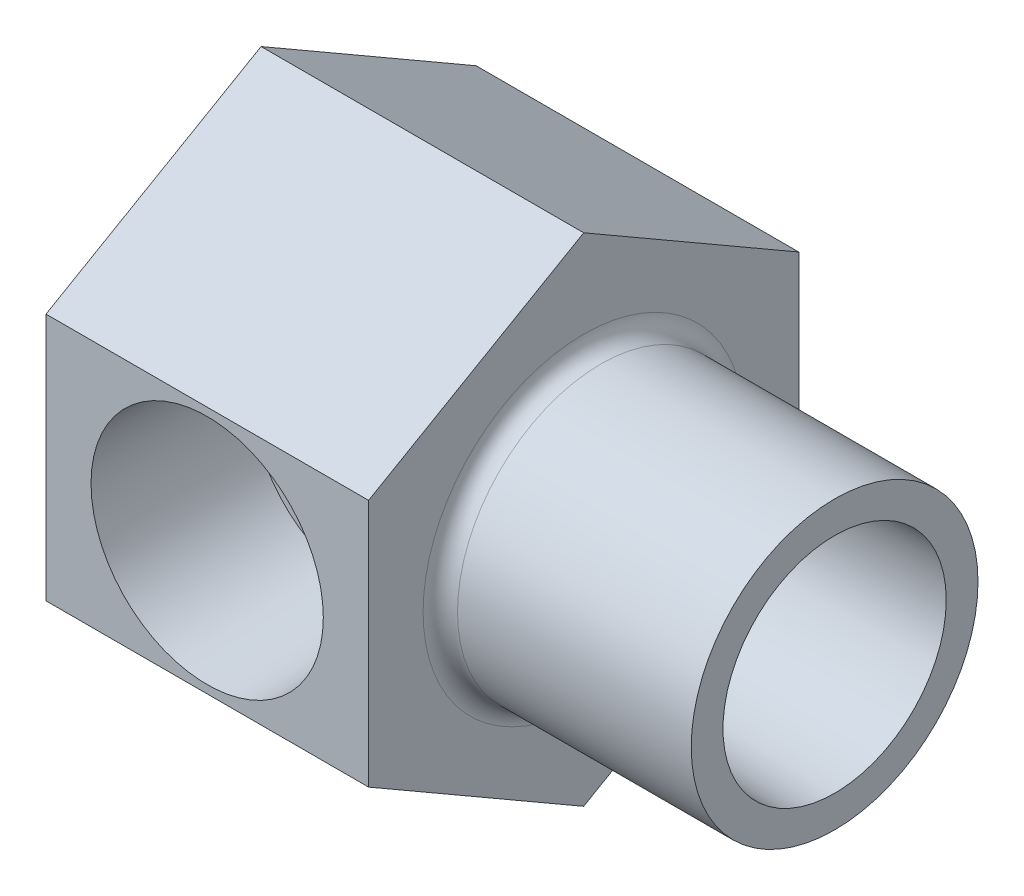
ISO-10303-21;
HEADER;
FILE_DESCRIPTION(('STEP AP214'),'2;1');
FILE_NAME('part.step','',(''),(''),'','','');
FILE_SCHEMA(('AUTOMOTIVE_DESIGN { 1 0 10303 214 1 1 1 1 }'));
ENDSEC;
DATA;
#1=APPLICATION_CONTEXT('core data for automotive mechanical design processes');
#2=APPLICATION_PROTOCOL_DEFINITION('international standard','automotive_design',2000,#1);
#3=PRODUCT_CONTEXT('',#1,'mechanical');
#4=PRODUCT('Part','Part','',(#3));
#5=PRODUCT_RELATED_PRODUCT_CATEGORY('part','',(#4));
#6=PRODUCT_DEFINITION_FORMATION('','',#4);
#7=PRODUCT_DEFINITION_CONTEXT('part definition',#1,'design');
#8=PRODUCT_DEFINITION('design','',#6,#7);
#9=PRODUCT_DEFINITION_SHAPE('','',#8);
#10=(LENGTH_UNIT() NAMED_UNIT(*) SI_UNIT(.MILLI.,.METRE.));
#11=(NAMED_UNIT(*) PLANE_ANGLE_UNIT() SI_UNIT($,.RADIAN.));
#12=(NAMED_UNIT(*) SI_UNIT($,.STERADIAN.) SOLID_ANGLE_UNIT());
#13=UNCERTAINTY_MEASURE_WITH_UNIT(LENGTH_MEASURE(1.E-05),#10,'distance_accuracy_value','');
#14=(GEOMETRIC_REPRESENTATION_CONTEXT(3) GLOBAL_UNCERTAINTY_ASSIGNED_CONTEXT((#13)) GLOBAL_UNIT_ASSIGNED_CONTEXT((#10,
#11,#12)) REPRESENTATION_CONTEXT('',''));
#15=CARTESIAN_POINT('',(0.,0.,0.));
#16=DIRECTION('',(0.,0.,1.));
#17=DIRECTION('',(1.,0.,0.));
#18=AXIS2_PLACEMENT_3D('',#15,#16,#17);
#19=CARTESIAN_POINT('',(-6.9596,0.,0.));
#20=DIRECTION('',(1.,0.,0.));
#21=DIRECTION('',(0.,0.,-1.));
#22=AXIS2_PLACEMENT_3D('',#19,#20,#21);
#23=CONICAL_SURFACE('',#22,4.2164,1.02974425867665);
#24=CARTESIAN_POINT('',(-6.73376018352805,3.22891481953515,-3.26541976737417));
#25=CARTESIAN_POINT('',(-6.73947200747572,3.29609728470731,-3.185629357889));
#26=CARTESIAN_POINT('',(-6.74538598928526,3.36029462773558,-3.10334220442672));
#27=CARTESIAN_POINT('',(-6.7575935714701,3.48238703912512,-2.93425567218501));
#28=CARTESIAN_POINT('',(-6.7638871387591,3.54028265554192,-2.84745668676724));
#29=CARTESIAN_POINT('',(-6.77684374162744,3.64956563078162,-2.66962780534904));
#30=CARTESIAN_POINT('',(-6.78350752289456,3.70093911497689,-2.57858943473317));
#31=CARTESIAN_POINT('',(-6.79716565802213,3.79675451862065,-2.39295588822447));
#32=CARTESIAN_POINT('',(-6.80416003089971,3.84119603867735,-2.29836050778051));
#33=CARTESIAN_POINT('',(-6.81940631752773,3.92836238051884,-2.09328071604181));
#34=CARTESIAN_POINT('',(-6.82770134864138,3.97006355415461,-1.98236269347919));
#35=CARTESIAN_POINT('',(-6.84463376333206,4.04393671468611,-1.75742117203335));
#36=CARTESIAN_POINT('',(-6.8532711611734,4.07610830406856,-1.64339754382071));
#37=CARTESIAN_POINT('',(-6.87082068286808,4.13063558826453,-1.41330247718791));
#38=CARTESIAN_POINT('',(-6.87973219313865,4.15301170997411,-1.29723583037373));
#39=CARTESIAN_POINT('',(-6.89779137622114,4.18787866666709,-1.06369323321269));
#40=CARTESIAN_POINT('',(-6.90693893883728,4.2003740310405,-0.946217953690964));
#41=CARTESIAN_POINT('',(-6.92329024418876,4.2136785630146,-0.737768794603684));
#42=CARTESIAN_POINT('',(-6.93045699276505,4.21651498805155,-0.646916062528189));
#43=CARTESIAN_POINT('',(-6.94487329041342,4.21627786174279,-0.465214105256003));
#44=CARTESIAN_POINT('',(-6.95212284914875,4.21320361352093,-0.374364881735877));
#45=CARTESIAN_POINT('',(-6.96885138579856,4.19935208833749,-0.165960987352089));
#46=CARTESIAN_POINT('',(-6.97834931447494,4.18654776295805,-0.0485372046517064));
#47=CARTESIAN_POINT('',(-6.99737520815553,4.15106537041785,0.184852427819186));
#48=CARTESIAN_POINT('',(-7.00690318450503,4.12838297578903,0.300817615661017));
#49=CARTESIAN_POINT('',(-7.02593176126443,4.07326389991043,0.53059288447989));
#50=CARTESIAN_POINT('',(-7.03543230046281,4.04081286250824,0.644399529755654));
#51=CARTESIAN_POINT('',(-7.05432381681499,3.96638566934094,0.86891078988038));
#52=CARTESIAN_POINT('',(-7.06371475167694,3.92440595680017,0.979614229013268));
#53=CARTESIAN_POINT('',(-7.08229902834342,3.8312791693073,1.19696658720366));
#54=CARTESIAN_POINT('',(-7.09149257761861,3.78014230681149,1.30361986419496));
#55=CARTESIAN_POINT('',(-7.10962004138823,3.66901304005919,1.51228248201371));
#56=CARTESIAN_POINT('',(-7.11855385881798,3.60901737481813,1.61429009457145));
#57=CARTESIAN_POINT('',(-7.1360737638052,3.48066096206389,1.81281840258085));
#58=CARTESIAN_POINT('',(-7.14466011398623,3.41230669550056,1.90934326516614));
#59=CARTESIAN_POINT('',(-7.16141704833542,3.26765530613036,2.09634161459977));
#60=CARTESIAN_POINT('',(-7.16958747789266,3.19135526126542,2.18681285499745));
#61=CARTESIAN_POINT('',(-7.18542989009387,3.03138463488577,2.36101374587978));
#62=CARTESIAN_POINT('',(-7.19310192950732,2.94771489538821,2.44474416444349));
#63=CARTESIAN_POINT('',(-7.20787423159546,2.77355964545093,2.6049115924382));
#64=CARTESIAN_POINT('',(-7.21497428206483,2.68307162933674,2.68134589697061));
#65=CARTESIAN_POINT('',(-7.22852278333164,2.49597839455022,2.82632284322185));
#66=CARTESIAN_POINT('',(-7.23497142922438,2.39937502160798,2.8948678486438));
#67=CARTESIAN_POINT('',(-7.24715119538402,2.20067639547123,3.02363152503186));
#68=CARTESIAN_POINT('',(-7.25288204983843,2.09857912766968,3.08384711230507));
#69=CARTESIAN_POINT('',(-7.26355643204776,1.88968543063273,3.19547701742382));
#70=CARTESIAN_POINT('',(-7.26850022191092,1.78289058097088,3.24689426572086));
#71=CARTESIAN_POINT('',(-7.27754633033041,1.56529157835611,3.34060580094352));
#72=CARTESIAN_POINT('',(-7.28164833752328,1.45448595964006,3.38289671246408));
#73=CARTESIAN_POINT('',(-7.28895737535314,1.22972174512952,3.45801767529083));
#74=CARTESIAN_POINT('',(-7.29216474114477,1.11576434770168,3.49085126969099));
#75=CARTESIAN_POINT('',(-7.29764824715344,0.885466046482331,3.54685856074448));
#76=CARTESIAN_POINT('',(-7.29992404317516,0.769124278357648,3.57002868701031));
#77=CARTESIAN_POINT('',(-7.30530210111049,0.417866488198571,3.62472545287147));
#78=CARTESIAN_POINT('',(-7.30696375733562,0.180450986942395,3.64152743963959));
#79=CARTESIAN_POINT('',(-7.30634050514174,-0.293714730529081,3.6352076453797));
#80=CARTESIAN_POINT('',(-7.30405560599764,-0.530464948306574,3.61208595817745));
#81=CARTESIAN_POINT('',(-7.29566099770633,-0.996716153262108,3.52661690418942));
#82=CARTESIAN_POINT('',(-7.28955164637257,-1.2262178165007,3.46427320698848));
#83=CARTESIAN_POINT('',(-7.27381113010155,-1.67143805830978,3.30211300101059));
#84=CARTESIAN_POINT('',(-7.26417998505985,-1.88715671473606,3.20229670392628));
#85=CARTESIAN_POINT('',(-7.24185058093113,-2.29871947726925,2.96800412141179));
#86=CARTESIAN_POINT('',(-7.22915208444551,-2.49456204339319,2.83352515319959));
#87=CARTESIAN_POINT('',(-7.20124690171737,-2.86080409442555,2.53370051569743));
#88=CARTESIAN_POINT('',(-7.18604008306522,-3.03120223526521,2.36835321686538));
#89=CARTESIAN_POINT('',(-7.15373137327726,-3.34173868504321,2.01144326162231));
#90=CARTESIAN_POINT('',(-7.13662909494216,-3.48187079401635,1.81987524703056));
#91=CARTESIAN_POINT('',(-7.10116480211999,-3.7278239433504,1.41600572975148));
#92=CARTESIAN_POINT('',(-7.08280311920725,-3.83365397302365,1.20370967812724));
#93=CARTESIAN_POINT('',(-7.04691898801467,-4.00110507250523,0.781889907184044));
#94=CARTESIAN_POINT('',(-7.02944568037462,-4.06556937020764,0.573484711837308));
#95=CARTESIAN_POINT('',(-6.99439704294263,-4.16139473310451,0.149206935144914));
#96=CARTESIAN_POINT('',(-6.97682171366,-4.19275596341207,-0.0666656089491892));
#97=CARTESIAN_POINT('',(-6.94047902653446,-4.22284116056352,-0.519424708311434));
#98=CARTESIAN_POINT('',(-6.92173924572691,-4.21852420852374,-0.756520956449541));
#99=CARTESIAN_POINT('',(-6.88509942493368,-4.17001705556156,-1.22674372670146));
#100=CARTESIAN_POINT('',(-6.86719970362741,-4.12581184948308,-1.45986872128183));
#101=CARTESIAN_POINT('',(-6.83266356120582,-3.99877765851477,-1.91548196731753));
#102=CARTESIAN_POINT('',(-6.81602745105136,-3.9159392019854,-2.13796759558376));
#103=CARTESIAN_POINT('',(-6.78439344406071,-3.71398256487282,-2.56583018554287));
#104=CARTESIAN_POINT('',(-6.76939415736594,-3.59489549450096,-2.77122162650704));
#105=CARTESIAN_POINT('',(-6.74772297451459,-3.38563805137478,-3.07082385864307));
#106=CARTESIAN_POINT('',(-6.74036352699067,-3.30690755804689,-3.17315498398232));
#107=CARTESIAN_POINT('',(-6.72627390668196,-3.14051730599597,-3.37001977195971));
#108=CARTESIAN_POINT('',(-6.71954265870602,-3.0528733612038,-3.46456672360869));
#109=CARTESIAN_POINT('',(-6.71313562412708,-2.9610208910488,-3.55494720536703));
#110=B_SPLINE_CURVE_WITH_KNOTS('',3,(#24,#25,#26,#27,#28,#29,#30,#31,#32,#33,#34,#35,#36,#37,
#38,#39,#40,#41,#42,#43,#44,#45,#46,#47,#48,#49,#50,#51,#52,#53,#54,#55,#56,#57,#58,#59,#60,#61,
#62,#63,#64,#65,#66,#67,#68,#69,#70,#71,#72,#73,#74,#75,#76,#77,#78,#79,#80,#81,#82,#83,#84,#85,
#86,#87,#88,#89,#90,#91,#92,#93,#94,#95,#96,#97,#98,#99,#100,#101,#102,#103,#104,#105,#106,#107,
#108,#109),.UNSPECIFIED.,.F.,.F.,(4,2,2,2,2,2,2,2,2,2,2,2,2,2,2,2,2,2,2,2,2,2,2,2,2,2,2,2,2,2,2,
2,2,2,2,2,2,2,2,2,2,2,4),(0.,0.313315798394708,0.626604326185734,0.94054853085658,
1.25451081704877,1.61044299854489,1.9663900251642,2.32159120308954,2.6766294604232,
2.94998279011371,3.22336835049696,3.57843483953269,3.93365703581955,4.28940384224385,
4.64528365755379,5.00076902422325,5.35638557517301,5.71172812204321,6.0672018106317,
6.4226349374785,6.77819932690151,7.13365690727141,7.48924573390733,7.8447158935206,
8.2003173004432,8.55578531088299,8.91138454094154,9.6217489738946,10.3321117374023,
11.0424080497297,11.7527003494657,12.4630476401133,13.1734324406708,13.8839626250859,
14.5943064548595,15.2482430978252,15.9021764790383,16.6123853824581,17.3228615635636,
18.0335120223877,18.7435542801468,19.1310374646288,19.5178448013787),.UNSPECIFIED.);
#111=CARTESIAN_POINT('',(-6.9596,4.20701167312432,-0.281214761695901));
#112=VERTEX_POINT('',#111);
#113=CARTESIAN_POINT('',(-6.9596,-4.20701167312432,-0.281214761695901));
#114=VERTEX_POINT('',#113);
#115=EDGE_CURVE('E228',#112,#114,#110,.T.);
#116=ORIENTED_EDGE('',*,*,#115,.F.);
#117=CARTESIAN_POINT('',(-6.9596,0.,0.));
#118=DIRECTION('',(1.,0.,0.));
#119=DIRECTION('',(0.,0.,-1.));
#120=AXIS2_PLACEMENT_3D('',#117,#118,#119);
#121=CIRCLE('',#120,4.2164);
#122=EDGE_CURVE('E266',#112,#114,#121,.T.);
#123=ORIENTED_EDGE('',*,*,#122,.T.);
#124=EDGE_LOOP('',(#116,#123));
#125=FACE_BOUND('',#124,.T.);
#126=ADVANCED_FACE('F16',(#125),#23,.F.);
#127=CARTESIAN_POINT('',(0.,0.,0.));
#128=DIRECTION('',(1.,0.,0.));
#129=DIRECTION('',(0.,0.,-1.));
#130=AXIS2_PLACEMENT_3D('',#127,#128,#129);
#131=CYLINDRICAL_SURFACE('',#130,4.2164);
#132=CARTESIAN_POINT('',(2.1310769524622E-12,0.,0.));
#133=DIRECTION('',(0.0403737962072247,0.,-0.999184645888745));
#134=DIRECTION('',(0.999184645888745,0.,0.0403737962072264));
#135=AXIS2_PLACEMENT_3D('',#132,#133,#134);
#136=ELLIPSE('',#135,104.434073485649,4.2164);
#137=CARTESIAN_POINT('',(-6.9342,4.20708015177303,-0.280188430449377));
#138=VERTEX_POINT('',#137);
#139=EDGE_CURVE('E234',#138,#112,#136,.F.);
#140=ORIENTED_EDGE('',*,*,#139,.F.);
#141=CARTESIAN_POINT('',(-6.9342,0.,0.));
#142=DIRECTION('',(1.,0.,0.));
#143=DIRECTION('',(0.,0.,-1.));
#144=AXIS2_PLACEMENT_3D('',#141,#142,#143);
#145=CIRCLE('',#144,4.2164);
#146=CARTESIAN_POINT('',(-6.9342,-4.20708015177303,-0.280188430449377));
#147=VERTEX_POINT('',#146);
#148=EDGE_CURVE('E263',#138,#147,#145,.T.);
#149=ORIENTED_EDGE('',*,*,#148,.T.);
#150=EDGE_CURVE('E235',#114,#147,#136,.F.);
#151=ORIENTED_EDGE('',*,*,#150,.F.);
#152=ORIENTED_EDGE('',*,*,#122,.F.);
#153=EDGE_LOOP('',(#140,#149,#151,#152));
#154=FACE_BOUND('',#153,.T.);
#155=ADVANCED_FACE('F213',(#154),#131,.F.);
#156=CARTESIAN_POINT('',(0.,0.,0.));
#157=DIRECTION('',(1.,0.,0.));
#158=DIRECTION('',(0.,0.,-1.));
#159=AXIS2_PLACEMENT_3D('',#156,#157,#158);
#160=CONICAL_SURFACE('',#159,4.9437925,0.0299323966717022);
#161=CARTESIAN_POINT('',(0.,0.,0.));
#162=DIRECTION('',(1.,0.,0.));
#163=DIRECTION('',(0.,0.,-1.));
#164=AXIS2_PLACEMENT_3D('',#161,#162,#163);
#165=CIRCLE('',#164,4.9437925);
#166=CARTESIAN_POINT('',(0.,0.,-4.9437925));
#167=VERTEX_POINT('',#166);
#168=EDGE_CURVE('E257',#167,#167,#165,.T.);
#169=ORIENTED_EDGE('',*,*,#168,.T.);
#170=EDGE_LOOP('',(#169));
#171=FACE_BOUND('',#170,.T.);
#172=CARTESIAN_POINT('',(-7.91478868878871,-2.92402848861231,-3.68838002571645));
#173=CARTESIAN_POINT('',(-7.82394341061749,-2.8614739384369,-3.74143604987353));
#174=CARTESIAN_POINT('',(-7.73588177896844,-2.79496841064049,-3.79479620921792));
#175=CARTESIAN_POINT('',(-7.56602887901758,-2.6535876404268,-3.90113119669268));
#176=CARTESIAN_POINT('',(-7.48425498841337,-2.57869051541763,-3.95410461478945));
#177=CARTESIAN_POINT('',(-7.32905229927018,-2.42127873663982,-4.0577914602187));
#178=CARTESIAN_POINT('',(-7.25554010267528,-2.33885906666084,-4.10852358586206));
#179=CARTESIAN_POINT('',(-7.11678263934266,-2.16585512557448,-4.20696117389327));
#180=CARTESIAN_POINT('',(-7.05152394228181,-2.07528453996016,-4.25467148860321));
#181=CARTESIAN_POINT('',(-6.97152555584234,-1.95093930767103,-4.31459130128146));
#182=CARTESIAN_POINT('',(-6.95273559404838,-1.92064356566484,-4.32878249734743));
#183=CARTESIAN_POINT('',(-6.85013666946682,-1.74890426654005,-4.40686524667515));
#184=CARTESIAN_POINT('',(-6.77546943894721,-1.59949285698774,-4.46599002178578));
#185=CARTESIAN_POINT('',(-6.64736312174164,-1.28688337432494,-4.56988836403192));
#186=CARTESIAN_POINT('',(-6.59396347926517,-1.12366035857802,-4.61463523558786));
#187=CARTESIAN_POINT('',(-6.50960720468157,-0.787352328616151,-4.6863183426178));
#188=CARTESIAN_POINT('',(-6.47869310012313,-0.614249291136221,-4.71322082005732));
#189=CARTESIAN_POINT('',(-6.4401118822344,-0.263625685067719,-4.74691295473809));
#190=CARTESIAN_POINT('',(-6.43243252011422,-0.0861074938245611,-4.7537132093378));
#191=CARTESIAN_POINT('',(-6.44028854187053,0.262611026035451,-4.74680729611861));
#192=CARTESIAN_POINT('',(-6.45512922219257,0.433840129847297,-4.73371476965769));
#193=CARTESIAN_POINT('',(-6.50652022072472,0.770581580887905,-4.68911866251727));
#194=CARTESIAN_POINT('',(-6.54307427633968,0.936092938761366,-4.6576119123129));
#195=CARTESIAN_POINT('',(-6.6317185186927,1.23836523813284,-4.58312904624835));
#196=CARTESIAN_POINT('',(-6.68153179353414,1.37624091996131,-4.54189392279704));
#197=CARTESIAN_POINT('',(-6.79669045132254,1.64144093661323,-4.44923514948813));
#198=CARTESIAN_POINT('',(-6.86200631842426,1.76878470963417,-4.39783089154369));
#199=CARTESIAN_POINT('',(-6.93794000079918,1.89587678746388,-4.34004270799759));
#200=CARTESIAN_POINT('',(-6.94149692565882,1.90178700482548,-4.33733982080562));
#201=CARTESIAN_POINT('',(-7.03247207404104,2.05185877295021,-4.2683147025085));
#202=CARTESIAN_POINT('',(-7.13028409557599,2.18764959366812,-4.19658926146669));
#203=CARTESIAN_POINT('',(-7.2906250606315,2.37770281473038,-4.08441114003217));
#204=CARTESIAN_POINT('',(-7.34663144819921,2.43903133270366,-4.04606671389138));
#205=CARTESIAN_POINT('',(-7.46270830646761,2.55691167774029,-3.96848051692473));
#206=CARTESIAN_POINT('',(-7.52277320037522,2.6134698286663,-3.92924002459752));
#207=CARTESIAN_POINT('',(-7.58474673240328,2.66775128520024,-3.88977056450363));
#208=B_SPLINE_CURVE_WITH_KNOTS('',3,(#172,#173,#174,#175,#176,#177,#178,#179,#180,#181,#182,
#183,#184,#185,#186,#187,#188,#189,#190,#191,#192,#193,#194,#195,#196,#197,#198,#199,#200,#201,
#202,#203,#204,#205,#206,#207),.UNSPECIFIED.,.F.,.F.,(4,2,2,2,2,2,2,2,2,2,2,2,2,2,2,2,2,4),(0.,
0.367226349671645,0.735433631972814,1.09950620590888,1.46297851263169,1.5780887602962,
2.10709113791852,2.63707011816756,3.16804887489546,3.69874766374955,4.21340483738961,
4.72815062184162,5.18355388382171,5.63809694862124,5.66032378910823,6.20382141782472,
6.47809984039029,6.75200875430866),.UNSPECIFIED.);
#209=CARTESIAN_POINT('',(-6.9342,-1.88961702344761,-4.34288898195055));
#210=VERTEX_POINT('',#209);
#211=CARTESIAN_POINT('',(-6.9342,1.88961702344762,-4.34288898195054));
#212=VERTEX_POINT('',#211);
#213=EDGE_CURVE('E203',#210,#212,#208,.T.);
#214=ORIENTED_EDGE('',*,*,#213,.F.);
#215=CARTESIAN_POINT('',(-6.9342,0.,0.));
#216=DIRECTION('',(1.,0.,0.));
#217=DIRECTION('',(0.,0.,-1.));
#218=AXIS2_PLACEMENT_3D('',#215,#216,#217);
#219=CIRCLE('',#218,4.73617326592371);
#220=EDGE_CURVE('E260',#212,#210,#219,.T.);
#221=ORIENTED_EDGE('',*,*,#220,.F.);
#222=EDGE_LOOP('',(#214,#221));
#223=FACE_BOUND('',#222,.T.);
#224=ADVANCED_FACE('F209',(#171,#223),#160,.F.);
#225=CARTESIAN_POINT('',(-18.2626,0.,-3.175));
#226=DIRECTION('',(0.,0.,1.));
#227=DIRECTION('',(1.,0.,0.));
#228=AXIS2_PLACEMENT_3D('',#225,#226,#227);
#229=CONICAL_SURFACE('',#228,4.2164,1.02974425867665);
#230=CARTESIAN_POINT('',(-16.4223731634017,3.79399540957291,-3.1748));
#231=CARTESIAN_POINT('',(-16.5494208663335,3.77897557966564,-3.21619844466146));
#232=CARTESIAN_POINT('',(-16.6775732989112,3.76471367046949,-3.25506909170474));
#233=CARTESIAN_POINT('',(-16.9367747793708,3.73938224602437,-3.32561168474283));
#234=CARTESIAN_POINT('',(-17.0678345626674,3.72832795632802,-3.35724915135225));
#235=CARTESIAN_POINT('',(-17.3285073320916,3.71150936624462,-3.4099743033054));
#236=CARTESIAN_POINT('',(-17.4580516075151,3.70560061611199,-3.4313419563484));
#237=CARTESIAN_POINT('',(-17.7184381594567,3.70005884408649,-3.46263493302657));
#238=CARTESIAN_POINT('',(-17.8492769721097,3.70041210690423,-3.47258521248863));
#239=CARTESIAN_POINT('',(-18.0603553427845,3.70637316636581,-3.4786650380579));
#240=CARTESIAN_POINT('',(-18.1405649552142,3.70989277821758,-3.47865492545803));
#241=CARTESIAN_POINT('',(-18.3007776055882,3.71927058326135,-3.4741064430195));
#242=CARTESIAN_POINT('',(-18.380780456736,3.7251304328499,-3.46956486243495));
#243=CARTESIAN_POINT('',(-18.5416642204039,3.7389979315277,-3.45612478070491));
#244=CARTESIAN_POINT('',(-18.6225353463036,3.74704202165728,-3.44715002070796));
#245=CARTESIAN_POINT('',(-18.7834690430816,3.76476889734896,-3.42531366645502));
#246=CARTESIAN_POINT('',(-18.8635325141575,3.77444957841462,-3.41245704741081));
#247=CARTESIAN_POINT('',(-18.9431730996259,3.784729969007,-3.39789901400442));
#248=B_SPLINE_CURVE_WITH_KNOTS('',3,(#230,#231,#232,#233,#234,#235,#236,#237,#238,#239,#240,
#241,#242,#243,#244,#245,#246,#247),.UNSPECIFIED.,.F.,.F.,(4,2,2,2,2,2,2,2,4),(0.,
0.403642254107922,0.809170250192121,1.20290855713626,1.59578459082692,1.83649163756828,
2.07736935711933,2.32254300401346,2.56740374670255),.UNSPECIFIED.);
#249=CARTESIAN_POINT('',(-16.4229861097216,3.7939227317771,-3.175));
#250=VERTEX_POINT('',#249);
#251=CARTESIAN_POINT('',(-18.4442611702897,3.73061642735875,-3.46423220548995));
#252=VERTEX_POINT('',#251);
#253=EDGE_CURVE('E147',#250,#252,#248,.T.);
#254=ORIENTED_EDGE('',*,*,#253,.F.);
#255=CARTESIAN_POINT('',(-18.2626,0.,-3.175));
#256=DIRECTION('',(0.,0.,1.));
#257=DIRECTION('',(1.,0.,0.));
#258=AXIS2_PLACEMENT_3D('',#255,#256,#257);
#259=CIRCLE('',#258,4.2164);
#260=CARTESIAN_POINT('',(-16.4229861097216,-3.79392273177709,-3.175));
#261=VERTEX_POINT('',#260);
#262=EDGE_CURVE('E254',#250,#261,#259,.T.);
#263=ORIENTED_EDGE('',*,*,#262,.T.);
#264=CARTESIAN_POINT('',(-18.9431730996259,-3.78472996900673,-3.39789901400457));
#265=CARTESIAN_POINT('',(-18.8852287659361,-3.77725583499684,-3.40848105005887));
#266=CARTESIAN_POINT('',(-18.8270810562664,-3.7700945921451,-3.41817151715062));
#267=CARTESIAN_POINT('',(-18.7103740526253,-3.75657464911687,-3.43557028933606));
#268=CARTESIAN_POINT('',(-18.6518146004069,-3.75021627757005,-3.44327778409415));
#269=CARTESIAN_POINT('',(-18.4755441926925,-3.73261587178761,-3.46311936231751));
#270=CARTESIAN_POINT('',(-18.3572790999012,-3.72285366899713,-3.47196535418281));
#271=CARTESIAN_POINT('',(-18.1228526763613,-3.7086251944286,-3.47960728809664));
#272=CARTESIAN_POINT('',(-18.0067062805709,-3.7040411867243,-3.4786318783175));
#273=CARTESIAN_POINT('',(-17.7748972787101,-3.70014250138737,-3.46704366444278));
#274=CARTESIAN_POINT('',(-17.6592343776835,-3.70082391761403,-3.45643800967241));
#275=CARTESIAN_POINT('',(-17.4494791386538,-3.70641052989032,-3.42915068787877));
#276=CARTESIAN_POINT('',(-17.3551751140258,-3.7105507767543,-3.41386792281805));
#277=CARTESIAN_POINT('',(-17.1676380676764,-3.72149751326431,-3.37820294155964));
#278=CARTESIAN_POINT('',(-17.0744058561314,-3.72830589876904,-3.35781710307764));
#279=CARTESIAN_POINT('',(-16.8872546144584,-3.74409830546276,-3.31237636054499));
#280=CARTESIAN_POINT('',(-16.7933607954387,-3.75312413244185,-3.28723417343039));
#281=CARTESIAN_POINT('',(-16.6069244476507,-3.77262711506,-3.23344407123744));
#282=CARTESIAN_POINT('',(-16.5143796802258,-3.78310146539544,-3.20480294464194));
#283=CARTESIAN_POINT('',(-16.4223731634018,-3.79399540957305,-3.17479999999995));
#284=B_SPLINE_CURVE_WITH_KNOTS('',3,(#264,#265,#266,#267,#268,#269,#270,#271,#272,#273,#274,
#275,#276,#277,#278,#279,#280,#281,#282,#283),.UNSPECIFIED.,.F.,.F.,(4,2,2,2,2,2,2,2,2,4),(0.,
0.178112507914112,0.356297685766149,0.712784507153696,1.06099165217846,1.40894050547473,
1.69561478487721,1.98249313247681,2.27526254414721,2.56747269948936),.UNSPECIFIED.);
#285=CARTESIAN_POINT('',(-18.4442611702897,-3.73061642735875,-3.46423220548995));
#286=VERTEX_POINT('',#285);
#287=EDGE_CURVE('E169',#286,#261,#284,.T.);
#288=ORIENTED_EDGE('',*,*,#287,.F.);
#289=CARTESIAN_POINT('',(-18.2626,0.,-5.7084687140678));
#290=CARTESIAN_POINT('',(-18.2626020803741,-4.57479372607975E-06,-5.70846570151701));
#291=CARTESIAN_POINT('',(-18.2626041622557,-9.14745502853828E-06,-5.70846268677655));
#292=CARTESIAN_POINT('',(-18.2626121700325,-2.67210434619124E-05,-5.70845109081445));
#293=CARTESIAN_POINT('',(-18.2626181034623,-3.97113041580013E-05,-5.70844249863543));
#294=CARTESIAN_POINT('',(-18.2626477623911,-0.000104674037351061,-5.70839954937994));
#295=CARTESIAN_POINT('',(-18.2626714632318,-0.000156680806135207,-5.70836522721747));
#296=CARTESIAN_POINT('',(-18.2627899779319,-0.000416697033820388,-5.70819359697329));
#297=CARTESIAN_POINT('',(-18.2628848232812,-0.000624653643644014,-5.70805623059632));
#298=CARTESIAN_POINT('',(-18.2633589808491,-0.00166448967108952,-5.70736943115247));
#299=CARTESIAN_POINT('',(-18.2637380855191,-0.00249652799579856,-5.70682009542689));
#300=CARTESIAN_POINT('',(-18.2656328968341,-0.00665700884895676,-5.70407336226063));
#301=CARTESIAN_POINT('',(-18.2671464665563,-0.00998631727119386,-5.70187580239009));
#302=CARTESIAN_POINT('',(-18.2747021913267,-0.0266384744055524,-5.69088806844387));
#303=CARTESIAN_POINT('',(-18.2807079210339,-0.0399780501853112,-5.68209816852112));
#304=CARTESIAN_POINT('',(-18.3105392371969,-0.106767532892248,-5.63814680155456));
#305=CARTESIAN_POINT('',(-18.3337689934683,-0.160483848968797,-5.60298528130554));
#306=CARTESIAN_POINT('',(-18.4014178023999,-0.322737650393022,-5.49737423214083));
#307=CARTESIAN_POINT('',(-18.4437021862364,-0.432183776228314,-5.42692886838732));
#308=CARTESIAN_POINT('',(-18.5212501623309,-0.653555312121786,-5.28615182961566));
#309=CARTESIAN_POINT('',(-18.5565169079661,-0.765479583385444,-5.21582011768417));
#310=CARTESIAN_POINT('',(-18.6190049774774,-0.992881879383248,-5.07464328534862));
#311=CARTESIAN_POINT('',(-18.6461436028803,-1.10838405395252,-5.00379993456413));
#312=CARTESIAN_POINT('',(-18.6907290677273,-1.34147025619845,-4.86242825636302));
#313=CARTESIAN_POINT('',(-18.7081750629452,-1.45905446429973,-4.79189995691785));
#314=CARTESIAN_POINT('',(-18.7327960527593,-1.69611406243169,-4.65098169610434));
#315=CARTESIAN_POINT('',(-18.739923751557,-1.81559563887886,-4.58059383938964));
#316=CARTESIAN_POINT('',(-18.7438757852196,-2.05501620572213,-4.44038227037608));
#317=CARTESIAN_POINT('',(-18.7407020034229,-2.17495510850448,-4.37055845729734));
#318=CARTESIAN_POINT('',(-18.7258995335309,-2.39903547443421,-4.2404428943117));
#319=CARTESIAN_POINT('',(-18.7154149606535,-2.50321789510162,-4.18008401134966));
#320=CARTESIAN_POINT('',(-18.6880585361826,-2.71096044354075,-4.05972540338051));
#321=CARTESIAN_POINT('',(-18.6711852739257,-2.81452042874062,-3.99972576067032));
#322=CARTESIAN_POINT('',(-18.612248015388,-3.12430322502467,-3.81989270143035));
#323=CARTESIAN_POINT('',(-18.5619016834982,-3.3292016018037,-3.70047126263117));
#324=CARTESIAN_POINT('',(-18.4749650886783,-3.63257599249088,-3.52217831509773));
#325=CARTESIAN_POINT('',(-18.4442058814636,-3.73270811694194,-3.46308473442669));
#326=CARTESIAN_POINT('',(-18.3794752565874,-3.93198285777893,-3.34495098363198));
#327=CARTESIAN_POINT('',(-18.3455036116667,-4.03112540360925,-3.28591081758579));
#328=CARTESIAN_POINT('',(-18.2750989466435,-4.22788656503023,-3.1681804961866));
#329=CARTESIAN_POINT('',(-18.2386811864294,-4.32551066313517,-3.10949027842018));
#330=CARTESIAN_POINT('',(-18.1636342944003,-4.51985935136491,-2.9920997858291));
#331=CARTESIAN_POINT('',(-18.1250057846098,-4.61658418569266,-2.93339951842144));
#332=CARTESIAN_POINT('',(-18.0854726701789,-4.71291004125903,-2.87466739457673));
#333=B_SPLINE_CURVE_WITH_KNOTS('',3,(#289,#290,#291,#292,#293,#294,#295,#296,#297,#298,#299,
#300,#301,#302,#303,#304,#305,#306,#307,#308,#309,#310,#311,#312,#313,#314,#315,#316,#317,#318,
#319,#320,#321,#322,#323,#324,#325,#326,#327,#328,#329,#330,#331,#332),.UNSPECIFIED.,.F.,.F.,(4,
2,2,2,2,2,2,2,2,2,2,2,2,2,2,2,2,2,2,2,2,4),(0.,1.75780865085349E-05,6.75780888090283E-05,
0.000267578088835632,0.00106757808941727,0.00426757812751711,0.0170675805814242,
0.0682677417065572,0.273079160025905,0.683462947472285,1.09366191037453,1.50790271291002,
1.92217959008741,2.33834943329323,2.75444319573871,3.11683316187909,3.47930319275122,
4.2057199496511,4.56650732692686,4.92732024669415,5.28606054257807,5.64470039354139),.UNSPECIFIED.);
#334=CARTESIAN_POINT('',(-18.2626,0.,-5.7084687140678));
#335=VERTEX_POINT('',#334);
#336=EDGE_CURVE('E240',#335,#286,#333,.T.);
#337=ORIENTED_EDGE('',*,*,#336,.F.);
#338=CARTESIAN_POINT('',(-18.2626,0.,-5.7084687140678));
#339=CARTESIAN_POINT('',(-18.2626020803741,4.57479372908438E-06,-5.70846570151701));
#340=CARTESIAN_POINT('',(-18.2626041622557,9.14745503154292E-06,-5.70846268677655));
#341=CARTESIAN_POINT('',(-18.2626121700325,2.67210434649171E-05,-5.70845109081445));
#342=CARTESIAN_POINT('',(-18.2626181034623,3.9711304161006E-05,-5.70844249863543));
#343=CARTESIAN_POINT('',(-18.2626477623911,0.000104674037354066,-5.70839954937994));
#344=CARTESIAN_POINT('',(-18.2626714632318,0.000156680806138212,-5.70836522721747));
#345=CARTESIAN_POINT('',(-18.2627899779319,0.000416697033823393,-5.70819359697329));
#346=CARTESIAN_POINT('',(-18.2628848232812,0.000624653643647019,-5.70805623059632));
#347=CARTESIAN_POINT('',(-18.2633589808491,0.00166448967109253,-5.70736943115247));
#348=CARTESIAN_POINT('',(-18.2637380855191,0.00249652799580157,-5.70682009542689));
#349=CARTESIAN_POINT('',(-18.2656328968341,0.00665700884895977,-5.70407336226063));
#350=CARTESIAN_POINT('',(-18.2671464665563,0.00998631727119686,-5.70187580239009));
#351=CARTESIAN_POINT('',(-18.2747021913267,0.0266384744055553,-5.69088806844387));
#352=CARTESIAN_POINT('',(-18.2807079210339,0.0399780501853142,-5.68209816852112));
#353=CARTESIAN_POINT('',(-18.3105392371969,0.106767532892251,-5.63814680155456));
#354=CARTESIAN_POINT('',(-18.3337689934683,0.1604838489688,-5.60298528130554));
#355=CARTESIAN_POINT('',(-18.4014178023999,0.322737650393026,-5.49737423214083));
#356=CARTESIAN_POINT('',(-18.4437021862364,0.432183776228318,-5.42692886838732));
#357=CARTESIAN_POINT('',(-18.5212501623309,0.65355531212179,-5.28615182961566));
#358=CARTESIAN_POINT('',(-18.5565169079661,0.765479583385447,-5.21582011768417));
#359=CARTESIAN_POINT('',(-18.6190049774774,0.992881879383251,-5.07464328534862));
#360=CARTESIAN_POINT('',(-18.6461436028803,1.10838405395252,-5.00379993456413));
#361=CARTESIAN_POINT('',(-18.6907290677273,1.34147025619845,-4.86242825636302));
#362=CARTESIAN_POINT('',(-18.7081750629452,1.45905446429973,-4.79189995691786));
#363=CARTESIAN_POINT('',(-18.7327960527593,1.69611406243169,-4.65098169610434));
#364=CARTESIAN_POINT('',(-18.739923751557,1.81559563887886,-4.58059383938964));
#365=CARTESIAN_POINT('',(-18.7438757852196,2.05501620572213,-4.44038227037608));
#366=CARTESIAN_POINT('',(-18.7407020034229,2.17495510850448,-4.37055845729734));
#367=CARTESIAN_POINT('',(-18.7258995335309,2.39903547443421,-4.2404428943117));
#368=CARTESIAN_POINT('',(-18.7154149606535,2.50321789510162,-4.18008401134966));
#369=CARTESIAN_POINT('',(-18.6880585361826,2.71096044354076,-4.05972540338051));
#370=CARTESIAN_POINT('',(-18.6711852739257,2.81452042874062,-3.99972576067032));
#371=CARTESIAN_POINT('',(-18.612248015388,3.12430322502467,-3.81989270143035));
#372=CARTESIAN_POINT('',(-18.5619016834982,3.3292016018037,-3.70047126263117));
#373=CARTESIAN_POINT('',(-18.4749650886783,3.63257599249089,-3.52217831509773));
#374=CARTESIAN_POINT('',(-18.4442058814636,3.73270811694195,-3.46308473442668));
#375=CARTESIAN_POINT('',(-18.3794752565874,3.93198285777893,-3.34495098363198));
#376=CARTESIAN_POINT('',(-18.3455036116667,4.03112540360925,-3.28591081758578));
#377=CARTESIAN_POINT('',(-18.2750989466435,4.22788656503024,-3.1681804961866));
#378=CARTESIAN_POINT('',(-18.2386811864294,4.32551066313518,-3.10949027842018));
#379=CARTESIAN_POINT('',(-18.1636342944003,4.51985935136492,-2.9920997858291));
#380=CARTESIAN_POINT('',(-18.1250057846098,4.61658418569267,-2.93339951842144));
#381=CARTESIAN_POINT('',(-18.0854726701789,4.71291004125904,-2.87466739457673));
#382=B_SPLINE_CURVE_WITH_KNOTS('',3,(#338,#339,#340,#341,#342,#343,#344,#345,#346,#347,#348,
#349,#350,#351,#352,#353,#354,#355,#356,#357,#358,#359,#360,#361,#362,#363,#364,#365,#366,#367,
#368,#369,#370,#371,#372,#373,#374,#375,#376,#377,#378,#379,#380,#381),.UNSPECIFIED.,.F.,.F.,(4,
2,2,2,2,2,2,2,2,2,2,2,2,2,2,2,2,2,2,2,2,4),(0.,1.75780865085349E-05,6.75780888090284E-05,
0.000267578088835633,0.00106757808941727,0.00426757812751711,0.0170675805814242,
0.0682677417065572,0.273079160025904,0.683462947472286,1.09366191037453,1.50790271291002,
1.9221795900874,2.33834943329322,2.75444319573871,3.11683316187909,3.47930319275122,
4.2057199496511,4.56650732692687,4.92732024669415,5.28606054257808,5.6447003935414),.UNSPECIFIED.);
#383=EDGE_CURVE('E233',#252,#335,#382,.F.);
#384=ORIENTED_EDGE('',*,*,#383,.F.);
#385=EDGE_LOOP('',(#254,#263,#288,#337,#384));
#386=FACE_BOUND('',#385,.T.);
#387=ADVANCED_FACE('F180',(#386),#229,.F.);
#388=CARTESIAN_POINT('',(-18.2626,0.,9.525));
#389=DIRECTION('',(0.,0.,1.));
#390=DIRECTION('',(1.,0.,0.));
#391=AXIS2_PLACEMENT_3D('',#388,#389,#390);
#392=CYLINDRICAL_SURFACE('',#391,4.2164);
#393=CARTESIAN_POINT('',(-18.2626,0.,-1.47827792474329));
#394=DIRECTION('',(-0.735078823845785,0.,0.677981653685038));
#395=DIRECTION('',(0.677981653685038,0.,0.735078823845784));
#396=AXIS2_PLACEMENT_3D('',#393,#394,#395);
#397=ELLIPSE('',#396,6.21904734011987,4.2164);
#398=CARTESIAN_POINT('',(-14.5095872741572,1.92169832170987,2.5908));
#399=VERTEX_POINT('',#398);
#400=CARTESIAN_POINT('',(-18.2626,4.2164,-1.47827792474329));
#401=VERTEX_POINT('',#400);
#402=EDGE_CURVE('E163',#399,#401,#397,.T.);
#403=ORIENTED_EDGE('',*,*,#402,.F.);
#404=CARTESIAN_POINT('',(-18.2626,0.,2.5908));
#405=DIRECTION('',(0.,0.,1.));
#406=DIRECTION('',(1.,0.,0.));
#407=AXIS2_PLACEMENT_3D('',#404,#405,#406);
#408=CIRCLE('',#407,4.2164);
#409=CARTESIAN_POINT('',(-14.5095872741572,-1.92169832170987,2.5908));
#410=VERTEX_POINT('',#409);
#411=EDGE_CURVE('E251',#399,#410,#408,.T.);
#412=ORIENTED_EDGE('',*,*,#411,.T.);
#413=CARTESIAN_POINT('',(-18.2626,-4.2164,-1.47827792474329));
#414=VERTEX_POINT('',#413);
#415=EDGE_CURVE('E160',#414,#410,#397,.T.);
#416=ORIENTED_EDGE('',*,*,#415,.F.);
#417=CARTESIAN_POINT('',(-18.2626,0.,-1.47827792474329));
#418=DIRECTION('',(0.677981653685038,0.,0.735078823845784));
#419=DIRECTION('',(-0.735078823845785,0.,0.677981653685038));
#420=AXIS2_PLACEMENT_3D('',#417,#418,#419);
#421=ELLIPSE('',#420,5.7359834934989,4.2164);
#422=CARTESIAN_POINT('',(-18.6326422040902,-4.20013067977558,-1.13697870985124));
#423=VERTEX_POINT('',#422);
#424=EDGE_CURVE('E150',#423,#414,#421,.T.);
#425=ORIENTED_EDGE('',*,*,#424,.F.);
#426=CARTESIAN_POINT('',(-18.2787770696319,-4.2163689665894,-3.1752));
#427=CARTESIAN_POINT('',(-18.3088188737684,-4.21625584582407,-3.07558799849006));
#428=CARTESIAN_POINT('',(-18.3374347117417,-4.21582288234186,-2.97554709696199));
#429=CARTESIAN_POINT('',(-18.3914112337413,-4.21451780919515,-2.77455864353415));
#430=CARTESIAN_POINT('',(-18.4167707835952,-4.2136455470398,-2.67361078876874));
#431=CARTESIAN_POINT('',(-18.4873747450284,-4.21066948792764,-2.36924357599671));
#432=CARTESIAN_POINT('',(-18.5270853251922,-4.2082074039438,-2.16449134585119));
#433=CARTESIAN_POINT('',(-18.5881502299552,-4.20392510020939,-1.7568014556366));
#434=CARTESIAN_POINT('',(-18.6098870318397,-4.20209201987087,-1.55392205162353));
#435=CARTESIAN_POINT('',(-18.6352858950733,-4.19991695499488,-1.14720940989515));
#436=CARTESIAN_POINT('',(-18.6389645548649,-4.19957360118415,-0.943377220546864));
#437=CARTESIAN_POINT('',(-18.6294411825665,-4.20041221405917,-0.539986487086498));
#438=CARTESIAN_POINT('',(-18.6165537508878,-4.20156575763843,-0.340419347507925));
#439=CARTESIAN_POINT('',(-18.5769135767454,-4.20471371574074,0.0575055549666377));
#440=CARTESIAN_POINT('',(-18.550143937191,-4.20670915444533,0.255861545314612));
#441=CARTESIAN_POINT('',(-18.4849032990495,-4.2106640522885,0.655285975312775));
#442=CARTESIAN_POINT('',(-18.4461770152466,-4.21262162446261,0.856311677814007));
#443=CARTESIAN_POINT('',(-18.3816296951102,-4.21477460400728,1.15613724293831));
#444=CARTESIAN_POINT('',(-18.3590728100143,-4.21536143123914,1.25565879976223));
#445=CARTESIAN_POINT('',(-18.3120785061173,-4.21617544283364,1.45424015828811));
#446=CARTESIAN_POINT('',(-18.2876414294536,-4.21640269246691,1.55330004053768));
#447=CARTESIAN_POINT('',(-18.2624,-4.21639999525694,1.6521550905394));
#448=B_SPLINE_CURVE_WITH_KNOTS('',3,(#426,#427,#428,#429,#430,#431,#432,#433,#434,#435,#436,
#437,#438,#439,#440,#441,#442,#443,#444,#445,#446,#447),.UNSPECIFIED.,.F.,.F.,(4,2,2,2,2,2,2,2,
2,2,4),(0.,0.312111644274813,0.62433170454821,1.24936975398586,1.86073749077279,
2.47154317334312,3.07091884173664,3.67102577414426,4.28495322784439,4.59108163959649,
4.89715447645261),.UNSPECIFIED.);
#449=CARTESIAN_POINT('',(-18.5773888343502,-4.20463279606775,-1.81957713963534));
#450=VERTEX_POINT('',#449);
#451=EDGE_CURVE('E29',#450,#423,#448,.T.);
#452=ORIENTED_EDGE('',*,*,#451,.F.);
#453=CARTESIAN_POINT('',(-18.2626,0.,-1.47827792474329));
#454=DIRECTION('',(-0.735078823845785,0.,0.677981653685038));
#455=DIRECTION('',(0.677981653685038,0.,0.735078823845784));
#456=AXIS2_PLACEMENT_3D('',#453,#454,#455);
#457=ELLIPSE('',#456,6.21904734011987,4.2164);
#458=EDGE_CURVE('E159',#414,#450,#457,.F.);
#459=ORIENTED_EDGE('',*,*,#458,.F.);
#460=CARTESIAN_POINT('',(-18.2626,0.,-1.47827792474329));
#461=DIRECTION('',(0.677981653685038,0.,0.735078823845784));
#462=DIRECTION('',(-0.735078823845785,0.,0.677981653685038));
#463=AXIS2_PLACEMENT_3D('',#460,#461,#462);
#464=ELLIPSE('',#463,5.7359834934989,4.2164);
#465=EDGE_CURVE('E162',#261,#414,#464,.F.);
#466=ORIENTED_EDGE('',*,*,#465,.F.);
#467=ORIENTED_EDGE('',*,*,#262,.F.);
#468=EDGE_CURVE('E148',#401,#250,#464,.F.);
#469=ORIENTED_EDGE('',*,*,#468,.F.);
#470=CARTESIAN_POINT('',(-18.5773888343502,4.20463279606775,-1.81957713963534));
#471=VERTEX_POINT('',#470);
#472=EDGE_CURVE('E141',#471,#401,#457,.F.);
#473=ORIENTED_EDGE('',*,*,#472,.F.);
#474=CARTESIAN_POINT('',(-18.2624,4.21639999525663,1.65215509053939));
#475=CARTESIAN_POINT('',(-18.2919867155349,4.21640525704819,1.53625624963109));
#476=CARTESIAN_POINT('',(-18.320479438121,4.21609125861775,1.420069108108));
#477=CARTESIAN_POINT('',(-18.3748171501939,4.21499307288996,1.18704088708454));
#478=CARTESIAN_POINT('',(-18.4006612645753,4.2142087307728,1.07019960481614));
#479=CARTESIAN_POINT('',(-18.4493288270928,4.21233428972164,0.835346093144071));
#480=CARTESIAN_POINT('',(-18.4721384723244,4.21124285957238,0.717330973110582));
#481=CARTESIAN_POINT('',(-18.5140395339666,4.20894805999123,0.480662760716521));
#482=CARTESIAN_POINT('',(-18.5331312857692,4.20774470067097,0.362009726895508));
#483=CARTESIAN_POINT('',(-18.5829887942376,4.20434263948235,0.0115022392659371));
#484=CARTESIAN_POINT('',(-18.6077212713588,4.20227879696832,-0.221295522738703));
#485=CARTESIAN_POINT('',(-18.6291439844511,4.20044225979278,-0.571208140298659));
#486=CARTESIAN_POINT('',(-18.633675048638,4.20003975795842,-0.687864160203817));
#487=CARTESIAN_POINT('',(-18.6371338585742,4.19973304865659,-0.92125655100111));
#488=CARTESIAN_POINT('',(-18.6360620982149,4.19982879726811,-1.03799291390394));
#489=CARTESIAN_POINT('',(-18.6262380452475,4.20069564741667,-1.32425853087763));
#490=CARTESIAN_POINT('',(-18.6142186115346,4.20175371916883,-1.49368590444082));
#491=CARTESIAN_POINT('',(-18.5779008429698,4.2046327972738,-1.83135200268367));
#492=CARTESIAN_POINT('',(-18.5535910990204,4.2064545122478,-1.99958947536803));
#493=CARTESIAN_POINT('',(-18.4932312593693,4.21019719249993,-2.33729053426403));
#494=CARTESIAN_POINT('',(-18.4569613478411,4.21211940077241,-2.50671399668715));
#495=CARTESIAN_POINT('',(-18.3747015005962,4.21511005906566,-2.84292505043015));
#496=CARTESIAN_POINT('',(-18.3287269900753,4.21617985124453,-3.00971637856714));
#497=CARTESIAN_POINT('',(-18.2787770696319,4.21636896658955,-3.1752));
#498=B_SPLINE_CURVE_WITH_KNOTS('',3,(#474,#475,#476,#477,#478,#479,#480,#481,#482,#483,#484,
#485,#486,#487,#488,#489,#490,#491,#492,#493,#494,#495,#496,#497),.UNSPECIFIED.,.F.,.F.,(4,2,2,
2,2,2,2,2,2,2,2,4),(0.,0.35885358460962,0.717825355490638,1.07837788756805,1.43889787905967,
2.14034254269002,2.49046188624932,2.84055036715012,3.34963572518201,3.85919453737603,
4.37869554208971,4.89737694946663),.UNSPECIFIED.);
#499=CARTESIAN_POINT('',(-18.6326422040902,4.20013067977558,-1.13697870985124));
#500=VERTEX_POINT('',#499);
#501=EDGE_CURVE('E10',#500,#471,#498,.T.);
#502=ORIENTED_EDGE('',*,*,#501,.F.);
#503=EDGE_CURVE('E136',#401,#500,#421,.T.);
#504=ORIENTED_EDGE('',*,*,#503,.F.);
#505=EDGE_LOOP('',(#403,#412,#416,#425,#452,#459,#466,#467,#469,#473,#502,#504));
#506=FACE_BOUND('',#505,.T.);
#507=ADVANCED_FACE('F157',(#506),#392,.F.);
#508=CARTESIAN_POINT('',(-18.2626,0.,9.525));
#509=DIRECTION('',(0.,0.,1.));
#510=DIRECTION('',(1.,0.,0.));
#511=AXIS2_PLACEMENT_3D('',#508,#509,#510);
#512=CONICAL_SURFACE('',#511,5.1438048,0.0299323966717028);
#513=CARTESIAN_POINT('',(-18.2626,0.,9.525));
#514=DIRECTION('',(0.,0.,1.));
#515=DIRECTION('',(1.,0.,0.));
#516=AXIS2_PLACEMENT_3D('',#513,#514,#515);
#517=CIRCLE('',#516,5.1438048);
#518=CARTESIAN_POINT('',(-13.1187952,0.,9.525));
#519=VERTEX_POINT('',#518);
#520=EDGE_CURVE('E245',#519,#519,#517,.T.);
#521=ORIENTED_EDGE('',*,*,#520,.T.);
#522=EDGE_LOOP('',(#521));
#523=FACE_BOUND('',#522,.T.);
#524=CARTESIAN_POINT('',(-13.765442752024,-2.03505417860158,2.5906));
#525=CARTESIAN_POINT('',(-13.7296981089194,-1.95932721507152,2.63536667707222));
#526=CARTESIAN_POINT('',(-13.6954718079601,-1.88161291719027,2.6780533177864));
#527=CARTESIAN_POINT('',(-13.6304803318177,-1.72234863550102,2.75884770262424));
#528=CARTESIAN_POINT('',(-13.5997184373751,-1.64079511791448,2.79695110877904));
#529=CARTESIAN_POINT('',(-13.5419677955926,-1.47360964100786,2.86829834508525));
#530=CARTESIAN_POINT('',(-13.5150040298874,-1.38795523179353,2.90151006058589));
#531=CARTESIAN_POINT('',(-13.4655495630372,-1.21342224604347,2.96229853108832));
#532=CARTESIAN_POINT('',(-13.443058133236,-1.12454419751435,2.98987620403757));
#533=CARTESIAN_POINT('',(-13.4028551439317,-0.943478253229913,3.03909538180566));
#534=CARTESIAN_POINT('',(-13.3851737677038,-0.851273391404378,3.06069941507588));
#535=CARTESIAN_POINT('',(-13.3551663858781,-0.664751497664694,3.09732614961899));
#536=CARTESIAN_POINT('',(-13.3428376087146,-0.570435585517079,3.1123522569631));
#537=CARTESIAN_POINT('',(-13.3238460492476,-0.380737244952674,3.13548620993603));
#538=CARTESIAN_POINT('',(-13.3171630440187,-0.285359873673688,3.14361874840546));
#539=CARTESIAN_POINT('',(-13.309552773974,-0.0940432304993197,3.1528789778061));
#540=CARTESIAN_POINT('',(-13.3086248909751,0.00189597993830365,3.15400742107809));
#541=CARTESIAN_POINT('',(-13.3123770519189,0.185160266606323,3.14944245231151));
#542=CARTESIAN_POINT('',(-13.3165773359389,0.27251024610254,3.1443326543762));
#543=CARTESIAN_POINT('',(-13.3297018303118,0.446332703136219,3.12835402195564));
#544=CARTESIAN_POINT('',(-13.3386275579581,0.532804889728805,3.11748333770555));
#545=CARTESIAN_POINT('',(-13.3723210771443,0.790449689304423,3.07640523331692));
#546=CARTESIAN_POINT('',(-13.4039964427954,0.959471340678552,3.0377422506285));
#547=CARTESIAN_POINT('',(-13.4834009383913,1.2872931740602,2.94041117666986));
#548=CARTESIAN_POINT('',(-13.5311122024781,1.44610449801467,2.88176534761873));
#549=CARTESIAN_POINT('',(-13.6123809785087,1.67458396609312,2.78126695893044));
#550=CARTESIAN_POINT('',(-13.6410032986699,1.74894558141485,2.74578429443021));
#551=CARTESIAN_POINT('',(-13.7011373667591,1.89443359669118,2.67098650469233));
#552=CARTESIAN_POINT('',(-13.732647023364,1.96556228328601,2.63167415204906));
#553=CARTESIAN_POINT('',(-13.765442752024,2.0350541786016,2.5906));
#554=B_SPLINE_CURVE_WITH_KNOTS('',3,(#524,#525,#526,#527,#528,#529,#530,#531,#532,#533,#534,
#535,#536,#537,#538,#539,#540,#541,#542,#543,#544,#545,#546,#547,#548,#549,#550,#551,#552,#553),
.UNSPECIFIED.,.F.,.F.,(4,2,2,2,2,2,2,2,2,2,2,2,2,2,4),(0.,0.284856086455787,0.569979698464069,
0.856898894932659,1.14377130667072,1.43240437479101,1.72088781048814,2.00833347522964,
2.29574826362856,2.55821635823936,2.82076877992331,3.34699715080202,3.87264117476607,
4.13414814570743,4.39546717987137),.UNSPECIFIED.);
#555=CARTESIAN_POINT('',(-13.7652830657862,-2.03471578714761,2.5908));
#556=VERTEX_POINT('',#555);
#557=CARTESIAN_POINT('',(-13.7652830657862,2.03471578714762,2.5908));
#558=VERTEX_POINT('',#557);
#559=EDGE_CURVE('E195',#556,#558,#554,.T.);
#560=ORIENTED_EDGE('',*,*,#559,.F.);
#561=CARTESIAN_POINT('',(-18.2626,0.,2.5908));
#562=DIRECTION('',(0.,0.,1.));
#563=DIRECTION('',(1.,0.,0.));
#564=AXIS2_PLACEMENT_3D('',#561,#562,#563);
#565=CIRCLE('',#564,4.9361855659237);
#566=EDGE_CURVE('E248',#558,#556,#565,.T.);
#567=ORIENTED_EDGE('',*,*,#566,.F.);
#568=EDGE_LOOP('',(#560,#567));
#569=FACE_BOUND('',#568,.T.);
#570=ADVANCED_FACE('F337',(#523,#569),#512,.F.);
#571=CARTESIAN_POINT('',(0.,0.,0.));
#572=DIRECTION('',(1.,0.,0.));
#573=DIRECTION('',(0.,0.,-1.));
#574=AXIS2_PLACEMENT_3D('',#571,#572,#573);
#575=CYLINDRICAL_SURFACE('',#574,6.35);
#576=CARTESIAN_POINT('',(-10.3505,0.,0.));
#577=DIRECTION('',(-1.,0.,0.));
#578=DIRECTION('',(0.,0.,1.));
#579=AXIS2_PLACEMENT_3D('',#576,#577,#578);
#580=CIRCLE('',#579,6.35);
#581=CARTESIAN_POINT('',(-10.3505,0.,6.35));
#582=VERTEX_POINT('',#581);
#583=EDGE_CURVE('E320',#582,#582,#580,.F.);
#584=ORIENTED_EDGE('',*,*,#583,.T.);
#585=EDGE_LOOP('',(#584));
#586=FACE_BOUND('',#585,.T.);
#587=CARTESIAN_POINT('',(0.,0.,0.));
#588=DIRECTION('',(1.,0.,0.));
#589=DIRECTION('',(0.,0.,-1.));
#590=AXIS2_PLACEMENT_3D('',#587,#588,#589);
#591=CIRCLE('',#590,6.35);
#592=CARTESIAN_POINT('',(0.,0.,-6.35));
#593=VERTEX_POINT('',#592);
#594=EDGE_CURVE('E308',#593,#593,#591,.T.);
#595=ORIENTED_EDGE('',*,*,#594,.F.);
#596=EDGE_LOOP('',(#595));
#597=FACE_BOUND('',#596,.T.);
#598=ADVANCED_FACE('F343',(#586,#597),#575,.T.);
#599=CARTESIAN_POINT('',(0.,0.,0.));
#600=DIRECTION('',(1.,0.,0.));
#601=DIRECTION('',(0.,0.,-1.));
#602=AXIS2_PLACEMENT_3D('',#599,#600,#601);
#603=PLANE('',#602);
#604=ORIENTED_EDGE('',*,*,#168,.F.);
#605=EDGE_LOOP('',(#604));
#606=FACE_BOUND('',#605,.T.);
#607=ORIENTED_EDGE('',*,*,#594,.T.);
#608=EDGE_LOOP('',(#607));
#609=FACE_BOUND('',#608,.T.);
#610=ADVANCED_FACE('F350',(#606,#609),#603,.T.);
#611=CARTESIAN_POINT('',(-11.1125,5.49926131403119,-9.525));
#612=DIRECTION('',(0.,0.,-1.));
#613=DIRECTION('',(0.,1.,0.));
#614=AXIS2_PLACEMENT_3D('',#611,#612,#613);
#615=PLANE('',#614);
#616=DIRECTION('',(0.,-1.,0.));
#617=VECTOR('',#616,1.);
#618=CARTESIAN_POINT('',(-25.4,5.49926131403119,-9.525));
#619=LINE('',#618,#617);
#620=CARTESIAN_POINT('',(-25.4,5.49926131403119,-9.525));
#621=VERTEX_POINT('',#620);
#622=CARTESIAN_POINT('',(-25.4,-5.49926131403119,-9.525));
#623=VERTEX_POINT('',#622);
#624=EDGE_CURVE('E269',#621,#623,#619,.T.);
#625=ORIENTED_EDGE('',*,*,#624,.F.);
#626=DIRECTION('',(-1.,0.,0.));
#627=VECTOR('',#626,1.);
#628=CARTESIAN_POINT('',(-11.1125,5.49926131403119,-9.525));
#629=LINE('',#628,#627);
#630=CARTESIAN_POINT('',(-11.1125,5.49926131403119,-9.525));
#631=VERTEX_POINT('',#630);
#632=EDGE_CURVE('E306',#631,#621,#629,.T.);
#633=ORIENTED_EDGE('',*,*,#632,.F.);
#634=DIRECTION('',(0.,-1.,0.));
#635=VECTOR('',#634,1.);
#636=CARTESIAN_POINT('',(-11.1125,5.49926131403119,-9.525));
#637=LINE('',#636,#635);
#638=CARTESIAN_POINT('',(-11.1125,-5.49926131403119,-9.525));
#639=VERTEX_POINT('',#638);
#640=EDGE_CURVE('E270',#631,#639,#637,.T.);
#641=ORIENTED_EDGE('',*,*,#640,.T.);
#642=DIRECTION('',(-1.,0.,0.));
#643=VECTOR('',#642,1.);
#644=CARTESIAN_POINT('',(-11.1125,-5.49926131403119,-9.525));
#645=LINE('',#644,#643);
#646=EDGE_CURVE('E289',#639,#623,#645,.T.);
#647=ORIENTED_EDGE('',*,*,#646,.T.);
#648=EDGE_LOOP('',(#625,#633,#641,#647));
#649=FACE_BOUND('',#648,.T.);
#650=ADVANCED_FACE('F508',(#649),#615,.T.);
#651=CARTESIAN_POINT('',(-11.1125,10.9985226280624,0.));
#652=DIRECTION('',(0.,0.866025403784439,-0.5));
#653=DIRECTION('',(0.,0.5,0.866025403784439));
#654=AXIS2_PLACEMENT_3D('',#651,#652,#653);
#655=PLANE('',#654);
#656=DIRECTION('',(0.,-0.5,-0.866025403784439));
#657=VECTOR('',#656,1.);
#658=CARTESIAN_POINT('',(-25.4,10.9985226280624,0.));
#659=LINE('',#658,#657);
#660=CARTESIAN_POINT('',(-25.4,10.9985226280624,0.));
#661=VERTEX_POINT('',#660);
#662=EDGE_CURVE('E274',#661,#621,#659,.T.);
#663=ORIENTED_EDGE('',*,*,#662,.F.);
#664=DIRECTION('',(-1.,0.,0.));
#665=VECTOR('',#664,1.);
#666=CARTESIAN_POINT('',(-11.1125,10.9985226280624,0.));
#667=LINE('',#666,#665);
#668=CARTESIAN_POINT('',(-11.1125,10.9985226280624,0.));
#669=VERTEX_POINT('',#668);
#670=EDGE_CURVE('E309',#669,#661,#667,.T.);
#671=ORIENTED_EDGE('',*,*,#670,.F.);
#672=DIRECTION('',(0.,-0.5,-0.866025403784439));
#673=VECTOR('',#672,1.);
#674=CARTESIAN_POINT('',(-11.1125,10.9985226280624,0.));
#675=LINE('',#674,#673);
#676=EDGE_CURVE('E286',#669,#631,#675,.T.);
#677=ORIENTED_EDGE('',*,*,#676,.T.);
#678=ORIENTED_EDGE('',*,*,#632,.T.);
#679=EDGE_LOOP('',(#663,#671,#677,#678));
#680=FACE_BOUND('',#679,.T.);
#681=ADVANCED_FACE('F499',(#680),#655,.T.);
#682=CARTESIAN_POINT('',(-11.1125,5.49926131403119,9.525));
#683=DIRECTION('',(0.,0.866025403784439,0.5));
#684=DIRECTION('',(0.,-0.5,0.866025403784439));
#685=AXIS2_PLACEMENT_3D('',#682,#683,#684);
#686=PLANE('',#685);
#687=DIRECTION('',(0.,0.5,-0.866025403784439));
#688=VECTOR('',#687,1.);
#689=CARTESIAN_POINT('',(-25.4,5.49926131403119,9.525));
#690=LINE('',#689,#688);
#691=CARTESIAN_POINT('',(-25.4,5.49926131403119,9.525));
#692=VERTEX_POINT('',#691);
#693=EDGE_CURVE('E301',#692,#661,#690,.T.);
#694=ORIENTED_EDGE('',*,*,#693,.F.);
#695=DIRECTION('',(-1.,0.,0.));
#696=VECTOR('',#695,1.);
#697=CARTESIAN_POINT('',(-11.1125,5.49926131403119,9.525));
#698=LINE('',#697,#696);
#699=CARTESIAN_POINT('',(-11.1125,5.49926131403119,9.525));
#700=VERTEX_POINT('',#699);
#701=EDGE_CURVE('E311',#700,#692,#698,.T.);
#702=ORIENTED_EDGE('',*,*,#701,.F.);
#703=DIRECTION('',(0.,0.5,-0.866025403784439));
#704=VECTOR('',#703,1.);
#705=CARTESIAN_POINT('',(-11.1125,5.49926131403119,9.525));
#706=LINE('',#705,#704);
#707=EDGE_CURVE('E283',#700,#669,#706,.T.);
#708=ORIENTED_EDGE('',*,*,#707,.T.);
#709=ORIENTED_EDGE('',*,*,#670,.T.);
#710=EDGE_LOOP('',(#694,#702,#708,#709));
#711=FACE_BOUND('',#710,.T.);
#712=ADVANCED_FACE('F491',(#711),#686,.T.);
#713=CARTESIAN_POINT('',(-11.1125,-5.49926131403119,9.525));
#714=DIRECTION('',(0.,0.,1.));
#715=DIRECTION('',(0.,-1.,0.));
#716=AXIS2_PLACEMENT_3D('',#713,#714,#715);
#717=PLANE('',#716);
#718=ORIENTED_EDGE('',*,*,#520,.F.);
#719=EDGE_LOOP('',(#718));
#720=FACE_BOUND('',#719,.T.);
#721=DIRECTION('',(0.,1.,0.));
#722=VECTOR('',#721,1.);
#723=CARTESIAN_POINT('',(-25.4,-5.49926131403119,9.525));
#724=LINE('',#723,#722);
#725=CARTESIAN_POINT('',(-25.4,-5.49926131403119,9.525));
#726=VERTEX_POINT('',#725);
#727=EDGE_CURVE('E298',#726,#692,#724,.T.);
#728=ORIENTED_EDGE('',*,*,#727,.F.);
#729=DIRECTION('',(-1.,0.,0.));
#730=VECTOR('',#729,1.);
#731=CARTESIAN_POINT('',(-11.1125,-5.49926131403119,9.525));
#732=LINE('',#731,#730);
#733=CARTESIAN_POINT('',(-11.1125,-5.49926131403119,9.525));
#734=VERTEX_POINT('',#733);
#735=EDGE_CURVE('E313',#734,#726,#732,.T.);
#736=ORIENTED_EDGE('',*,*,#735,.F.);
#737=DIRECTION('',(0.,1.,0.));
#738=VECTOR('',#737,1.);
#739=CARTESIAN_POINT('',(-11.1125,-5.49926131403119,9.525));
#740=LINE('',#739,#738);
#741=EDGE_CURVE('E280',#734,#700,#740,.T.);
#742=ORIENTED_EDGE('',*,*,#741,.T.);
#743=ORIENTED_EDGE('',*,*,#701,.T.);
#744=EDGE_LOOP('',(#728,#736,#742,#743));
#745=FACE_BOUND('',#744,.T.);
#746=ADVANCED_FACE('F481',(#720,#745),#717,.T.);
#747=CARTESIAN_POINT('',(-11.1125,-10.9985226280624,0.));
#748=DIRECTION('',(0.,-0.866025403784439,0.5));
#749=DIRECTION('',(0.,-0.5,-0.866025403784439));
#750=AXIS2_PLACEMENT_3D('',#747,#748,#749);
#751=PLANE('',#750);
#752=DIRECTION('',(0.,0.5,0.866025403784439));
#753=VECTOR('',#752,1.);
#754=CARTESIAN_POINT('',(-25.4,-10.9985226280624,0.));
#755=LINE('',#754,#753);
#756=CARTESIAN_POINT('',(-25.4,-10.9985226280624,0.));
#757=VERTEX_POINT('',#756);
#758=EDGE_CURVE('E295',#757,#726,#755,.T.);
#759=ORIENTED_EDGE('',*,*,#758,.F.);
#760=DIRECTION('',(-1.,0.,0.));
#761=VECTOR('',#760,1.);
#762=CARTESIAN_POINT('',(-11.1125,-10.9985226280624,0.));
#763=LINE('',#762,#761);
#764=CARTESIAN_POINT('',(-11.1125,-10.9985226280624,0.));
#765=VERTEX_POINT('',#764);
#766=EDGE_CURVE('E315',#765,#757,#763,.T.);
#767=ORIENTED_EDGE('',*,*,#766,.F.);
#768=DIRECTION('',(0.,0.5,0.866025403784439));
#769=VECTOR('',#768,1.);
#770=CARTESIAN_POINT('',(-11.1125,-10.9985226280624,0.));
#771=LINE('',#770,#769);
#772=EDGE_CURVE('E277',#765,#734,#771,.T.);
#773=ORIENTED_EDGE('',*,*,#772,.T.);
#774=ORIENTED_EDGE('',*,*,#735,.T.);
#775=EDGE_LOOP('',(#759,#767,#773,#774));
#776=FACE_BOUND('',#775,.T.);
#777=ADVANCED_FACE('F472',(#776),#751,.T.);
#778=CARTESIAN_POINT('',(-11.1125,-5.49926131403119,-9.525));
#779=DIRECTION('',(0.,-0.866025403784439,-0.5));
#780=DIRECTION('',(0.,0.5,-0.866025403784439));
#781=AXIS2_PLACEMENT_3D('',#778,#779,#780);
#782=PLANE('',#781);
#783=DIRECTION('',(0.,-0.5,0.866025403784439));
#784=VECTOR('',#783,1.);
#785=CARTESIAN_POINT('',(-25.4,-5.49926131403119,-9.525));
#786=LINE('',#785,#784);
#787=EDGE_CURVE('E292',#623,#757,#786,.T.);
#788=ORIENTED_EDGE('',*,*,#787,.F.);
#789=ORIENTED_EDGE('',*,*,#646,.F.);
#790=DIRECTION('',(0.,-0.5,0.866025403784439));
#791=VECTOR('',#790,1.);
#792=CARTESIAN_POINT('',(-11.1125,-5.49926131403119,-9.525));
#793=LINE('',#792,#791);
#794=EDGE_CURVE('E273',#639,#765,#793,.T.);
#795=ORIENTED_EDGE('',*,*,#794,.T.);
#796=ORIENTED_EDGE('',*,*,#766,.T.);
#797=EDGE_LOOP('',(#788,#789,#795,#796));
#798=FACE_BOUND('',#797,.T.);
#799=ADVANCED_FACE('F466',(#798),#782,.T.);
#800=CARTESIAN_POINT('',(-11.1125,0.,0.));
#801=DIRECTION('',(-1.,0.,0.));
#802=DIRECTION('',(0.,0.,1.));
#803=AXIS2_PLACEMENT_3D('',#800,#801,#802);
#804=PLANE('',#803);
#805=CARTESIAN_POINT('',(-11.1125,0.,0.));
#806=DIRECTION('',(-1.,0.,0.));
#807=DIRECTION('',(0.,0.,1.));
#808=AXIS2_PLACEMENT_3D('',#805,#806,#807);
#809=CIRCLE('',#808,7.112);
#810=CARTESIAN_POINT('',(-11.1125,0.,7.112));
#811=VERTEX_POINT('',#810);
#812=EDGE_CURVE('E322',#811,#811,#809,.T.);
#813=ORIENTED_EDGE('',*,*,#812,.T.);
#814=EDGE_LOOP('',(#813));
#815=FACE_BOUND('',#814,.T.);
#816=ORIENTED_EDGE('',*,*,#640,.F.);
#817=ORIENTED_EDGE('',*,*,#676,.F.);
#818=ORIENTED_EDGE('',*,*,#707,.F.);
#819=ORIENTED_EDGE('',*,*,#741,.F.);
#820=ORIENTED_EDGE('',*,*,#772,.F.);
#821=ORIENTED_EDGE('',*,*,#794,.F.);
#822=EDGE_LOOP('',(#816,#817,#818,#819,#820,#821));
#823=FACE_BOUND('',#822,.T.);
#824=ADVANCED_FACE('F226',(#815,#823),#804,.F.);
#825=CARTESIAN_POINT('',(-25.4,6.35,0.));
#826=DIRECTION('',(-1.,0.,0.));
#827=DIRECTION('',(0.,0.,1.));
#828=AXIS2_PLACEMENT_3D('',#825,#826,#827);
#829=PLANE('',#828);
#830=ORIENTED_EDGE('',*,*,#624,.T.);
#831=ORIENTED_EDGE('',*,*,#787,.T.);
#832=ORIENTED_EDGE('',*,*,#758,.T.);
#833=ORIENTED_EDGE('',*,*,#727,.T.);
#834=ORIENTED_EDGE('',*,*,#693,.T.);
#835=ORIENTED_EDGE('',*,*,#662,.T.);
#836=EDGE_LOOP('',(#830,#831,#832,#833,#834,#835));
#837=FACE_BOUND('',#836,.T.);
#838=ADVANCED_FACE('F448',(#837),#829,.T.);
#839=CARTESIAN_POINT('',(-10.3505,0.,0.));
#840=DIRECTION('',(-1.,0.,0.));
#841=DIRECTION('',(0.,0.,1.));
#842=AXIS2_PLACEMENT_3D('',#839,#840,#841);
#843=TOROIDAL_SURFACE('',#842,7.112,0.762);
#844=ORIENTED_EDGE('',*,*,#812,.F.);
#845=EDGE_LOOP('',(#844));
#846=FACE_BOUND('',#845,.T.);
#847=ORIENTED_EDGE('',*,*,#583,.F.);
#848=EDGE_LOOP('',(#847));
#849=FACE_BOUND('',#848,.T.);
#850=ADVANCED_FACE('F18',(#846,#849),#843,.F.);
#851=CARTESIAN_POINT('',(-6.9342,4.2164,0.));
#852=DIRECTION('',(-1.,0.,0.));
#853=DIRECTION('',(0.,0.,1.));
#854=AXIS2_PLACEMENT_3D('',#851,#852,#853);
#855=PLANE('',#854);
#856=CARTESIAN_POINT('',(-6.9342,0.,-0.561293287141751));
#857=DIRECTION('',(-1.,0.,0.));
#858=DIRECTION('',(0.,0.,-1.));
#859=AXIS2_PLACEMENT_3D('',#856,#857,#858);
#860=ELLIPSE('',#859,4.23019078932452,4.2164);
#861=EDGE_CURVE('E581',#212,#138,#860,.F.);
#862=ORIENTED_EDGE('',*,*,#861,.F.);
#863=ORIENTED_EDGE('',*,*,#220,.T.);
#864=EDGE_CURVE('E36',#147,#210,#860,.F.);
#865=ORIENTED_EDGE('',*,*,#864,.F.);
#866=ORIENTED_EDGE('',*,*,#148,.F.);
#867=EDGE_LOOP('',(#862,#863,#865,#866));
#868=FACE_BOUND('',#867,.T.);
#869=ADVANCED_FACE('F215',(#868),#855,.F.);
#870=CARTESIAN_POINT('',(-14.0462,0.,2.5908));
#871=DIRECTION('',(0.,0.,-1.));
#872=DIRECTION('',(-1.,0.,0.));
#873=AXIS2_PLACEMENT_3D('',#870,#871,#872);
#874=PLANE('',#873);
#875=CARTESIAN_POINT('',(32.0066634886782,0.,2.5908));
#876=DIRECTION('',(0.,0.,-1.));
#877=DIRECTION('',(-1.,0.,0.));
#878=AXIS2_PLACEMENT_3D('',#875,#876,#877);
#879=ELLIPSE('',#878,52.259646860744,4.2164);
#880=EDGE_CURVE('E44',#410,#556,#879,.F.);
#881=ORIENTED_EDGE('',*,*,#880,.F.);
#882=ORIENTED_EDGE('',*,*,#411,.F.);
#883=EDGE_CURVE('E153',#558,#399,#879,.F.);
#884=ORIENTED_EDGE('',*,*,#883,.F.);
#885=ORIENTED_EDGE('',*,*,#566,.T.);
#886=EDGE_LOOP('',(#881,#882,#884,#885));
#887=FACE_BOUND('',#886,.T.);
#888=ADVANCED_FACE('F187',(#887),#874,.F.);
#889=CARTESIAN_POINT('',(-58.022823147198,0.,-4.69669480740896));
#890=DIRECTION('',(-0.996739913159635,0.,-0.0806817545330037));
#891=DIRECTION('',(-0.0806817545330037,0.,0.996739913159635));
#892=AXIS2_PLACEMENT_3D('',#889,#890,#891);
#893=CYLINDRICAL_SURFACE('',#892,4.2164);
#894=ORIENTED_EDGE('',*,*,#253,.T.);
#895=CARTESIAN_POINT('',(-18.6027865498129,0.,-1.50581454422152));
#896=DIRECTION('',(-0.996739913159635,0.,-0.0806817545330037));
#897=DIRECTION('',(-0.0806817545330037,0.,0.996739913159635));
#898=AXIS2_PLACEMENT_3D('',#895,#896,#897);
#899=CIRCLE('',#898,4.2164);
#900=EDGE_CURVE('E154',#252,#335,#899,.T.);
#901=ORIENTED_EDGE('',*,*,#900,.T.);
#902=EDGE_CURVE('E366',#335,#286,#899,.T.);
#903=ORIENTED_EDGE('',*,*,#902,.T.);
#904=ORIENTED_EDGE('',*,*,#287,.T.);
#905=ORIENTED_EDGE('',*,*,#465,.T.);
#906=ORIENTED_EDGE('',*,*,#415,.T.);
#907=ORIENTED_EDGE('',*,*,#880,.T.);
#908=ORIENTED_EDGE('',*,*,#559,.T.);
#909=ORIENTED_EDGE('',*,*,#883,.T.);
#910=ORIENTED_EDGE('',*,*,#402,.T.);
#911=ORIENTED_EDGE('',*,*,#468,.T.);
#912=EDGE_LOOP('',(#894,#901,#903,#904,#905,#906,#907,#908,#909,#910,#911));
#913=FACE_BOUND('',#912,.T.);
#914=ORIENTED_EDGE('',*,*,#115,.T.);
#915=ORIENTED_EDGE('',*,*,#150,.T.);
#916=ORIENTED_EDGE('',*,*,#864,.T.);
#917=ORIENTED_EDGE('',*,*,#213,.T.);
#918=ORIENTED_EDGE('',*,*,#861,.T.);
#919=ORIENTED_EDGE('',*,*,#139,.T.);
#920=EDGE_LOOP('',(#914,#915,#916,#917,#918,#919));
#921=FACE_BOUND('',#920,.T.);
#922=ADVANCED_FACE('F183',(#913,#921),#893,.F.);
#923=CARTESIAN_POINT('',(-18.6027865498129,0.,-1.50581454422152));
#924=DIRECTION('',(0.996739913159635,0.,0.0806817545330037));
#925=DIRECTION('',(0.0806817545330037,0.,-0.996739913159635));
#926=AXIS2_PLACEMENT_3D('',#923,#924,#925);
#927=CONICAL_SURFACE('',#926,4.2164,1.0471975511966);
#928=ORIENTED_EDGE('',*,*,#383,.T.);
#929=ORIENTED_EDGE('',*,*,#900,.F.);
#930=EDGE_LOOP('',(#928,#929));
#931=FACE_BOUND('',#930,.T.);
#932=ADVANCED_FACE('F186',(#931),#927,.F.);
#933=ORIENTED_EDGE('',*,*,#336,.T.);
#934=ORIENTED_EDGE('',*,*,#902,.F.);
#935=EDGE_LOOP('',(#933,#934));
#936=FACE_BOUND('',#935,.T.);
#937=ADVANCED_FACE('F189',(#936),#927,.F.);
#938=ORIENTED_EDGE('',*,*,#424,.T.);
#939=ORIENTED_EDGE('',*,*,#458,.T.);
#940=EDGE_CURVE('E156',#450,#423,#899,.T.);
#941=ORIENTED_EDGE('',*,*,#940,.T.);
#942=EDGE_LOOP('',(#938,#939,#941));
#943=FACE_BOUND('',#942,.T.);
#944=ADVANCED_FACE('F188',(#943),#893,.F.);
#945=ORIENTED_EDGE('',*,*,#451,.T.);
#946=ORIENTED_EDGE('',*,*,#940,.F.);
#947=EDGE_LOOP('',(#945,#946));
#948=FACE_BOUND('',#947,.T.);
#949=ADVANCED_FACE('F365',(#948),#927,.F.);
#950=ORIENTED_EDGE('',*,*,#501,.T.);
#951=EDGE_CURVE('E139',#500,#471,#899,.T.);
#952=ORIENTED_EDGE('',*,*,#951,.F.);
#953=EDGE_LOOP('',(#950,#952));
#954=FACE_BOUND('',#953,.T.);
#955=ADVANCED_FACE('F152',(#954),#927,.F.);
#956=ORIENTED_EDGE('',*,*,#503,.T.);
#957=ORIENTED_EDGE('',*,*,#951,.T.);
#958=ORIENTED_EDGE('',*,*,#472,.T.);
#959=EDGE_LOOP('',(#956,#957,#958));
#960=FACE_BOUND('',#959,.T.);
#961=ADVANCED_FACE('F138',(#960),#893,.F.);
#962=CLOSED_SHELL('',(#126,#155,#224,#387,#507,#570,#598,#610,#650,#681,#712,#746,#777,#799,
#824,#838,#850,#869,#888,#922,#932,#937,#944,#949,#955,#961));
#963=MANIFOLD_SOLID_BREP('B1',#962);
#964=ADVANCED_BREP_SHAPE_REPRESENTATION('',(#18,#963),#14);
#965=SHAPE_DEFINITION_REPRESENTATION(#9,#964);
ENDSEC;
END-ISO-10303-21;
